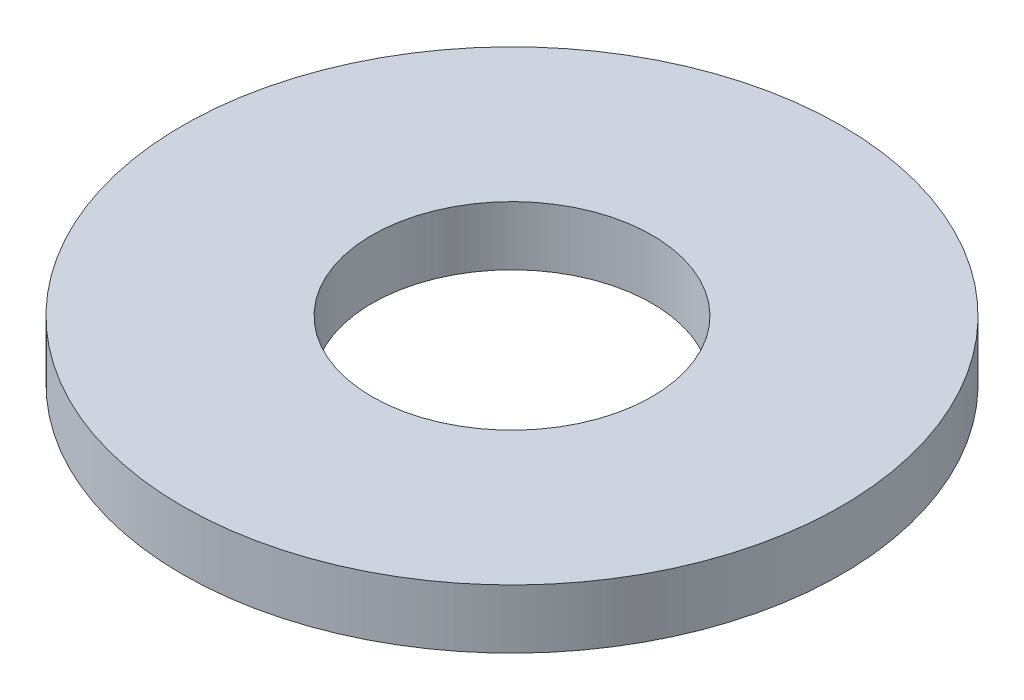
from build123d import *

# Parameters (mm, degrees)
SKETCH1_R          = 15.875
SKETCH1_R_2        = 6.7437
BASE_EXTRUDE_DEPTH = 2.8448


with BuildPart() as part:
    # Sketch1 → Base-Extrude (new body)
    with BuildSketch(Plane(origin=(0, 0, 0), x_dir=(1, 0, 0), z_dir=(0, 1, 0))):
        with Locations(Location((0, 0, 0), (0, 0, 270))):
            Circle(SKETCH1_R)
        with Locations(Location((0, 0, 0), (0, 0, 270))):
            Circle(SKETCH1_R_2, mode=Mode.SUBTRACT)
    extrude(amount=BASE_EXTRUDE_DEPTH)


solid = part.part
